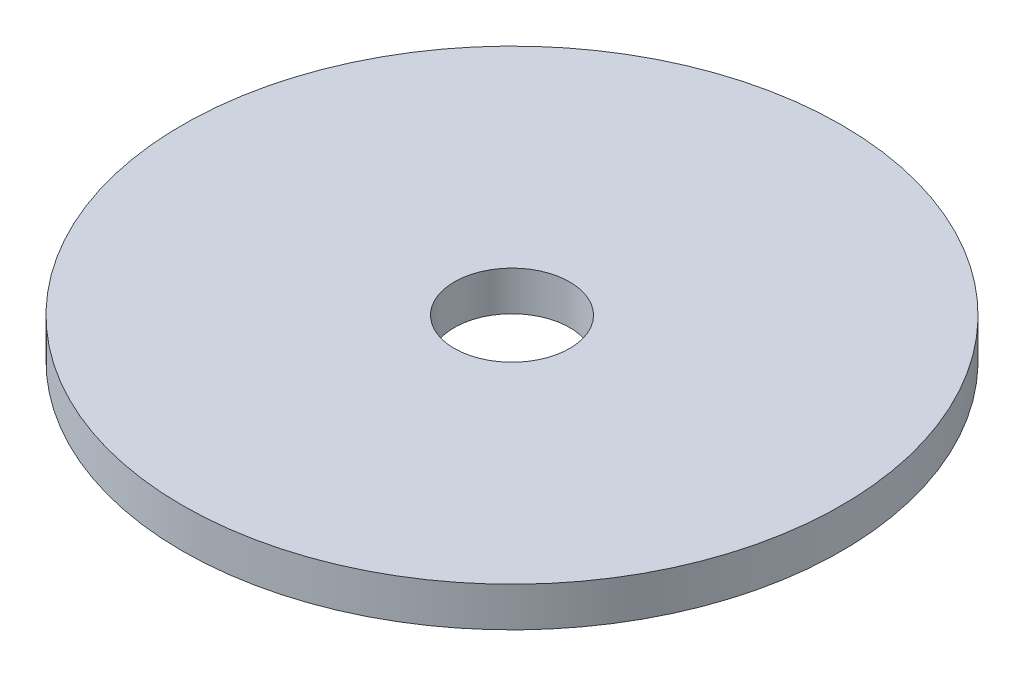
from build123d import *

# Parameters (mm, degrees)
SKETCH1_R           = 10
SKETCH1_R_2         = 1.75
BOSS_EXTRUDE1_DEPTH = 1.2


with BuildPart() as part:
    # Sketch1 → Boss-Extrude1 (new body)
    with BuildSketch(Plane(origin=(0, 0, 0), x_dir=(1, 0, 0), z_dir=(0, 1, 0))):
        with Locations(Location((0, 0, 0), (0, 0, 270))):
            Circle(SKETCH1_R)
        with Locations(Location((0, 0, 0), (0, 0, 270))):
            Circle(SKETCH1_R_2, mode=Mode.SUBTRACT)
    extrude(amount=BOSS_EXTRUDE1_DEPTH)


solid = part.part
